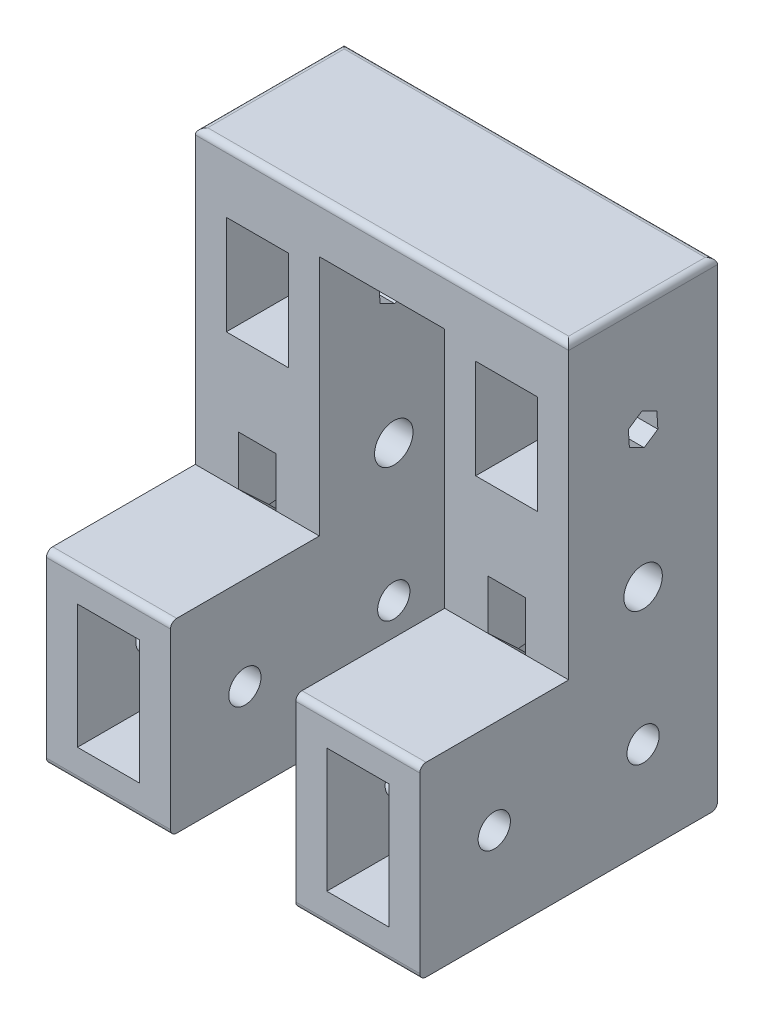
from build123d import *

# Parameters (mm, degrees)
EXTRUDE_1_DEPTH     = 30.1
SKETCH_2_R          = 2.6
SKETCH_2_R_2        = 3.1
CUT_EXTRUDE_1_DEPTH = 80.860876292
SKETCH_3_W          = 20.2
SKETCH_3_H          = 48
CUT_EXTRUDE_2_DEPTH = 69
SKETCH_4_W          = 10
SKETCH_4_H          = 16
CUT_EXTRUDE_3_DEPTH = 60.375348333
SKETCH_12_W         = 10
SKETCH_12_H         = 20
CUT_EXTRUDE_4_DEPTH = 73.480562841
FILLET_1_R          = 1


with BuildPart() as part:
    # Sketch 1 → Extrude 1 (new, symmetric)
    with BuildSketch(Plane.YZ):
        Polygon((-31.795774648, 21.348591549), (-31.795774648, -26.651408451), (45.204225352, -26.651408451), (45.204225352, -2.651408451), (-1.795774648, -2.651408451), (-1.795774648, 21.348591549), align=None)
    extrude(amount=EXTRUDE_1_DEPTH, both=True)

    # Sketch 2 → Cut-Extrude 1 (cut, through all)
    with BuildSketch(Plane.YZ.offset(30.1)):
        with Locations(Location((-16.795774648, 9.348591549, 0), (0, 0, 270))):
            Circle(SKETCH_2_R)
        with Locations(Location((-16.795774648, -14.651408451, 0), (0, 0, 270))):
            Circle(SKETCH_2_R)
        with Locations(Location((5.204225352, -14.651408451, 0), (0, 0, 270))):
            Circle(SKETCH_2_R_2)
        Polygon((28.672451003, -16.864471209), (29.854906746, -14.486419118), (28.386681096, -12.27335636), (25.735999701, -12.438345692), (24.553543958, -14.816397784), (26.021769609, -17.029460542), align=None)
    extrude(amount=-CUT_EXTRUDE_1_DEPTH, mode=Mode.SUBTRACT)

    # Sketch 3 → Cut-Extrude 2 (cut)
    with BuildSketch(Plane.XZ.offset(31.795774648)):
        with Locations((0, -2.651408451)):
            Rectangle(SKETCH_3_W, SKETCH_3_H)
    extrude(amount=-CUT_EXTRUDE_2_DEPTH, mode=Mode.SUBTRACT)

    # Sketch 4 → Cut-Extrude 3 (cut, through all)
    with BuildSketch(Plane.XY.offset(-2.651408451)):
        with Locations((-20.1, 27.204225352)):
            Rectangle(SKETCH_4_W, SKETCH_4_H)
        with Locations((20.1, 27.204225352)):
            Rectangle(SKETCH_4_W, SKETCH_4_H)
    extrude(amount=-CUT_EXTRUDE_3_DEPTH, mode=Mode.SUBTRACT)

    # Sketch 9 → Loft 1 section 0
    with BuildSketch(Plane.XY.offset(-2.651408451)):
        with BuildLine():
            Line((-23.1, -1.795774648), (-17.1, -1.795774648))
            Line((-17.1, -1.795774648), (-17.1, 6.204225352))
            Line((-17.1, 6.204225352), (-23.1, 6.204225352))
            Line((-23.1, 6.204225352), (-23.1, -1.795774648))
        make_face()
    # Sketch 8 → Loft 1 section 1
    with BuildSketch(Plane(origin=(0, 0, -26.651408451), x_dir=(1, 0, 0), z_dir=(0, 0, -1))):
        with BuildLine():
            Line((-25.1, 24.295774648), (-15.1, 24.295774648))
            Line((-15.1, 24.295774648), (-15.1, 9.295774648))
            Line((-15.1, 9.295774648), (-25.1, 9.295774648))
            Line((-25.1, 9.295774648), (-25.1, 24.295774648))
        make_face()
    loft(mode=Mode.SUBTRACT)

    # Sketch 11 → Loft 2 section 0
    with BuildSketch(Plane(origin=(0, 0, -26.651408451), x_dir=(1, 0, 0), z_dir=(0, 0, -1))):
        with BuildLine():
            Line((15.1, 24.295774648), (25.1, 24.295774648))
            Line((25.1, 24.295774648), (25.1, 9.295774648))
            Line((25.1, 9.295774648), (15.1, 9.295774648))
            Line((15.1, 9.295774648), (15.1, 24.295774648))
        make_face()
    # Sketch 10 → Loft 2 section 1
    with BuildSketch(Plane.XY.offset(-2.651408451)):
        with BuildLine():
            Line((17.1, -1.795774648), (23.1, -1.795774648))
            Line((23.1, -1.795774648), (23.1, 6.204225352))
            Line((23.1, 6.204225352), (17.1, 6.204225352))
            Line((17.1, 6.204225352), (17.1, -1.795774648))
        make_face()
    loft(mode=Mode.SUBTRACT)

    # Sketch 12 → Cut-Extrude 4 (cut, through all)
    with BuildSketch(Plane(origin=(0, 0, -26.651408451), x_dir=(1, 0, 0), z_dir=(0, 0, -1))):
        with Locations((-20.1, 16.795774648)):
            Rectangle(SKETCH_12_W, SKETCH_12_H)
        with Locations((20.1, 16.795774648)):
            Rectangle(SKETCH_12_W, SKETCH_12_H)
    extrude(amount=-CUT_EXTRUDE_4_DEPTH, mode=Mode.SUBTRACT)

    # Fillet 1
    fillet_1_edges = [part.edges().sort_by_distance(p)[0] for p in [
        (20.1, -1.795774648, 21.348591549),
        (0, 45.204225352, -2.651408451),
        (0, 45.204225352, -26.651408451),
        (20.1, -31.795774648, -26.651408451),
        (20.1, -31.795774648, 21.348591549),
        (30.1, 45.204225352, -14.651408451),
        (-20.1, -1.795774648, 21.348591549),
        (-20.1, -31.795774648, -26.651408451),
        (-20.1, -31.795774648, 21.348591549),
        (-30.1, 45.204225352, -14.651408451),
    ]]
    fillet(fillet_1_edges, radius=FILLET_1_R)


solid = part.part
